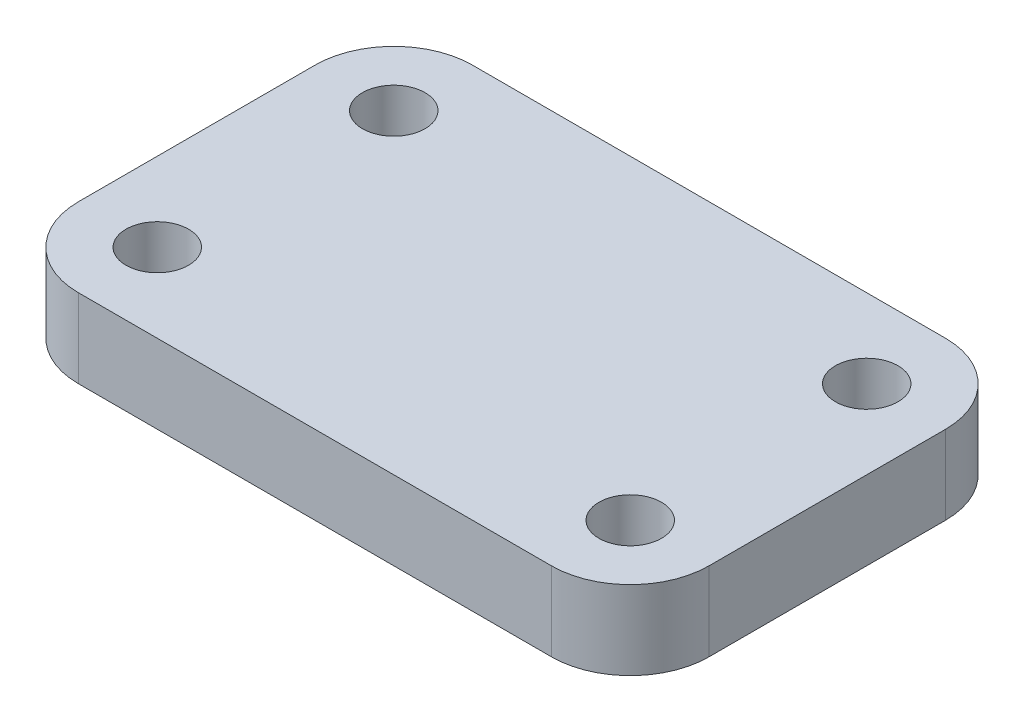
from build123d import *

# Parameters (mm, degrees)
SKETCH1_W               = 101.6
SKETCH1_H               = 63.5
EXTRUDE1_DEPTH          = 12.7
FILLET1_R               = 12.7
F_3_8_CLEARANCE_HOLE1_D = 10.0838


with BuildPart() as part:
    # Sketch1 → Extrude1 (new body)
    with BuildSketch(Plane(origin=(0, 0, 0), x_dir=(1, 0, 0), z_dir=(0, 1, 0))):
        with Locations((50.8, 31.75)):
            Rectangle(SKETCH1_W, SKETCH1_H)
    extrude(amount=EXTRUDE1_DEPTH)

    # Fillet1
    fillet1_edges = [part.edges().sort_by_distance(p)[0] for p in [
        (0, 6.35, -63.5),
        (101.6, 6.35, -63.5),
        (101.6, 6.35, 0),
        (0, 6.35, 0),
    ]]
    fillet(fillet1_edges, radius=FILLET1_R)

    # 3_8 Clearance Hole1 (through all)
    with Locations(Plane(origin=(0, 12.7, 0), x_dir=(-1, 0, 0), z_dir=(0, 1, 0))):
        with Locations((-12.7, -12.7), (-12.7, -50.8), (-88.9, -50.8), (-88.9, -12.7)):
            Hole(F_3_8_CLEARANCE_HOLE1_D / 2)


solid = part.part
